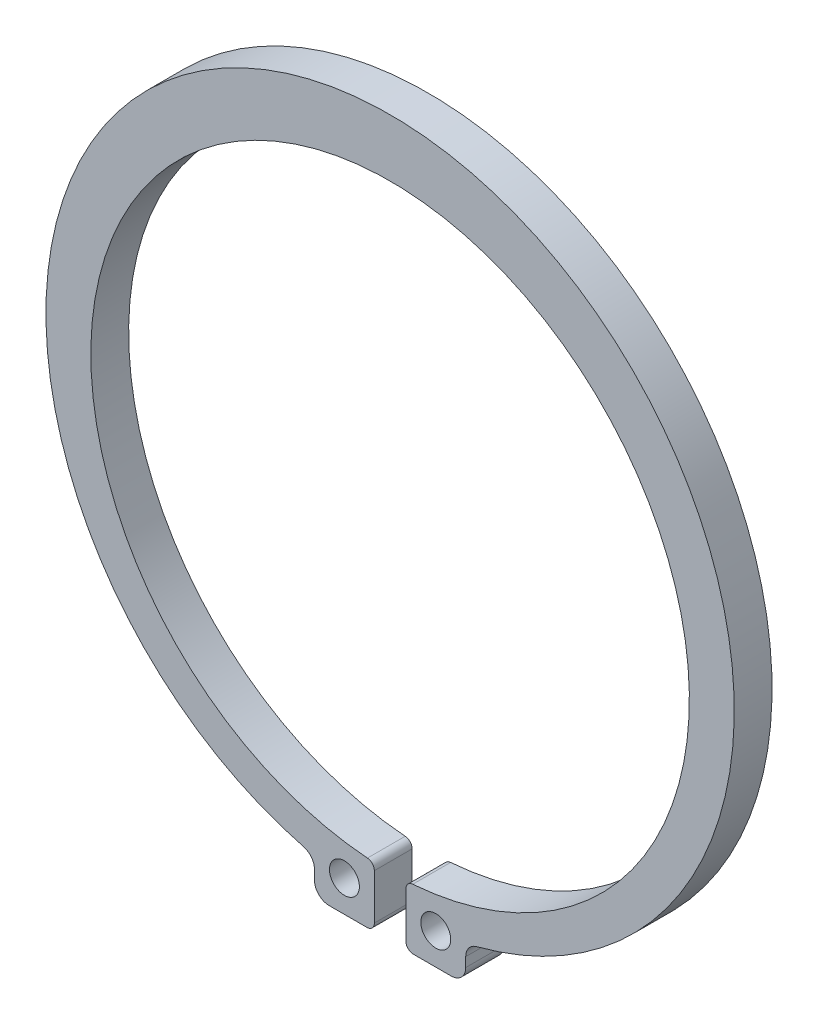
from build123d import *

# Parameters (mm, degrees)
ESQUISSE1_R             = 10.925
PAISSEUR_DEPTH          = 1.2
ESQUISSE2_R             = 9.5
DIAM_INT_DEPTH          = 16.496814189
FENTE_DEPTH             = 16.496814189
BOSS_DEPTH              = 1.2
ESQUISSE5_R             = 0.475
ENL_V_MAT_EXTRU_1_DEPTH = 17.115987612
CONG_4_R                = 0.463414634
CONG_5_R                = 0.2375


with BuildPart() as part:
    # Esquisse1 → paisseur (new body)
    with BuildSketch(Plane.XY):
        Circle(ESQUISSE1_R)
    extrude(amount=PAISSEUR_DEPTH)

    # Esquisse2 → diam int (cut, through all)
    with BuildSketch(Plane.XY.offset(1.2)):
        with Locations((0, -0.4)):
            Circle(ESQUISSE2_R)
    extrude(amount=-DIAM_INT_DEPTH, mode=Mode.SUBTRACT)

    # Esquisse3 → fente (cut, through all)
    with BuildSketch(Plane.XY.offset(1.2)):
        with BuildLine():
            Line((-0.5, -9.886832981), (-0.5, -10.913552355))
            ThreePointArc((-0.5, -10.913552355), (0, -10.925), (0.5, -10.913552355))
            Line((0.5, -10.913552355), (0.5, -9.886832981))
            ThreePointArc((0.5, -9.886832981), (0, -9.9), (-0.5, -9.886832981))
        make_face()
    extrude(amount=-FENTE_DEPTH, mode=Mode.SUBTRACT)

    # Esquisse4 → Boss (add)
    with BuildSketch(Plane.XY.offset(1.2)):
        with BuildLine():
            Line((0.5, -9.886832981), (0.5, -11.786832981))
            Line((0.5, -11.786832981), (2.4, -11.786832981))
            Line((2.4, -11.786832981), (2.4, -9.591844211))
            ThreePointArc((2.4, -9.591844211), (1.457482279, -9.78753138), (0.5, -9.886832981))
        make_face()
        with BuildLine():
            Line((-2.4, -11.786832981), (-2.4, -9.591844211))
            ThreePointArc((-2.4, -9.591844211), (-1.457482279, -9.78753138), (-0.5, -9.886832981))
            Line((-0.5, -9.886832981), (-0.5, -11.786832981))
            Line((-0.5, -11.786832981), (-2.4, -11.786832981))
        make_face()
    extrude(amount=-BOSS_DEPTH)

    # Esquisse5 → Enl_v. mat.-Extru.1 (cut, through all)
    with BuildSketch(Plane.XY.offset(1.2)):
        with Locations((-1.45, -10.787761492)):
            Circle(ESQUISSE5_R)
        with Locations(Location((1.45, -10.787761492, 0), (0, 0, 180))):
            Circle(ESQUISSE5_R)
    extrude(amount=-ENL_V_MAT_EXTRU_1_DEPTH, mode=Mode.SUBTRACT)

    # Cong_4
    cong_4_edges = [part.edges().sort_by_distance(p)[0] for p in [
        (-2.4, -10.658124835, 0.6),
        (-2.4, -11.786832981, 0.6),
        (2.4, -10.658124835, 0.6),
        (2.4, -11.786832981, 0.6),
    ]]
    fillet(cong_4_edges, radius=CONG_4_R)

    # Cong_5
    cong_5_edges = [part.edges().sort_by_distance(p)[0] for p in [
        (-0.5, -9.886832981, 0.6),
        (0.5, -9.886832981, 0.6),
        (-0.5, -11.786832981, 0.6),
        (0.5, -11.786832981, 0.6),
    ]]
    fillet(cong_5_edges, radius=CONG_5_R)


solid = part.part
